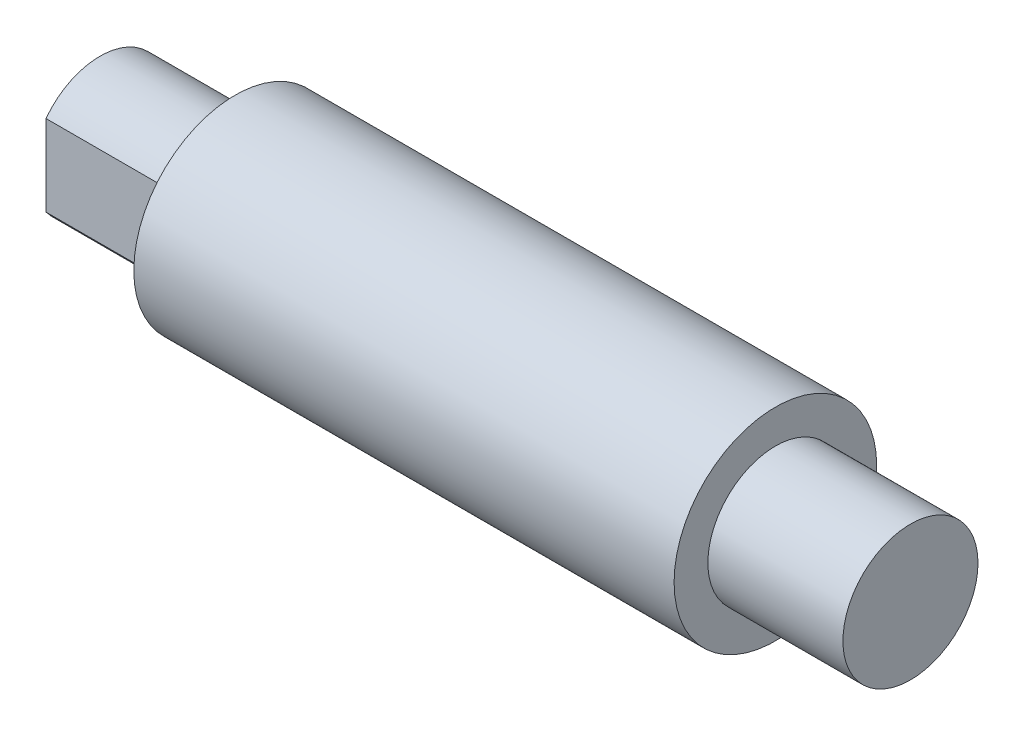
ISO-10303-21;
HEADER;
FILE_DESCRIPTION(('STEP AP214'),'2;1');
FILE_NAME('part.step','',(''),(''),'','','');
FILE_SCHEMA(('AUTOMOTIVE_DESIGN { 1 0 10303 214 1 1 1 1 }'));
ENDSEC;
DATA;
#1=APPLICATION_CONTEXT('core data for automotive mechanical design processes');
#2=APPLICATION_PROTOCOL_DEFINITION('international standard','automotive_design',2000,#1);
#3=PRODUCT_CONTEXT('',#1,'mechanical');
#4=PRODUCT('Part','Part','',(#3));
#5=PRODUCT_RELATED_PRODUCT_CATEGORY('part','',(#4));
#6=PRODUCT_DEFINITION_FORMATION('','',#4);
#7=PRODUCT_DEFINITION_CONTEXT('part definition',#1,'design');
#8=PRODUCT_DEFINITION('design','',#6,#7);
#9=PRODUCT_DEFINITION_SHAPE('','',#8);
#10=(LENGTH_UNIT() NAMED_UNIT(*) SI_UNIT(.MILLI.,.METRE.));
#11=(NAMED_UNIT(*) PLANE_ANGLE_UNIT() SI_UNIT($,.RADIAN.));
#12=(NAMED_UNIT(*) SI_UNIT($,.STERADIAN.) SOLID_ANGLE_UNIT());
#13=UNCERTAINTY_MEASURE_WITH_UNIT(LENGTH_MEASURE(1.E-05),#10,'distance_accuracy_value','');
#14=(GEOMETRIC_REPRESENTATION_CONTEXT(3) GLOBAL_UNCERTAINTY_ASSIGNED_CONTEXT((#13)) GLOBAL_UNIT_ASSIGNED_CONTEXT((#10,
#11,#12)) REPRESENTATION_CONTEXT('',''));
#15=CARTESIAN_POINT('',(0.,0.,0.));
#16=DIRECTION('',(0.,0.,1.));
#17=DIRECTION('',(1.,0.,0.));
#18=AXIS2_PLACEMENT_3D('',#15,#16,#17);
#19=CARTESIAN_POINT('',(60.,0.,0.));
#20=DIRECTION('',(-1.,0.,0.));
#21=DIRECTION('',(0.,0.,1.));
#22=AXIS2_PLACEMENT_3D('',#19,#20,#21);
#23=CYLINDRICAL_SURFACE('',#22,7.5);
#24=CARTESIAN_POINT('',(50.,0.,0.));
#25=DIRECTION('',(1.,0.,0.));
#26=DIRECTION('',(0.,0.,-1.));
#27=AXIS2_PLACEMENT_3D('',#24,#25,#26);
#28=CIRCLE('',#27,7.5);
#29=CARTESIAN_POINT('',(50.,0.,7.5));
#30=VERTEX_POINT('',#29);
#31=EDGE_CURVE('E12',#30,#30,#28,.T.);
#32=CARTESIAN_POINT('',(10.,0.,0.));
#33=DIRECTION('',(-1.,0.,0.));
#34=DIRECTION('',(0.,0.,1.));
#35=AXIS2_PLACEMENT_3D('',#32,#33,#34);
#36=CIRCLE('',#35,7.5);
#37=CARTESIAN_POINT('',(10.,0.,7.5));
#38=VERTEX_POINT('',#37);
#39=EDGE_CURVE('E38',#38,#38,#36,.T.);
#40=CARTESIAN_POINT('',(50.,0.,7.5));
#41=CARTESIAN_POINT('',(49.5833333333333,0.,7.5));
#42=CARTESIAN_POINT('',(49.1666666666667,0.,7.5));
#43=CARTESIAN_POINT('',(48.3333333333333,0.,7.5));
#44=CARTESIAN_POINT('',(47.9166666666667,0.,7.5));
#45=CARTESIAN_POINT('',(47.0833333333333,0.,7.5));
#46=CARTESIAN_POINT('',(46.6666666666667,0.,7.5));
#47=CARTESIAN_POINT('',(45.8333333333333,0.,7.5));
#48=CARTESIAN_POINT('',(45.4166666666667,0.,7.5));
#49=CARTESIAN_POINT('',(44.5833333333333,0.,7.5));
#50=CARTESIAN_POINT('',(44.1666666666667,0.,7.5));
#51=CARTESIAN_POINT('',(43.3333333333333,0.,7.5));
#52=CARTESIAN_POINT('',(42.9166666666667,0.,7.5));
#53=CARTESIAN_POINT('',(42.0833333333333,0.,7.5));
#54=CARTESIAN_POINT('',(41.6666666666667,0.,7.5));
#55=CARTESIAN_POINT('',(40.8333333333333,0.,7.5));
#56=CARTESIAN_POINT('',(40.4166666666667,0.,7.5));
#57=CARTESIAN_POINT('',(39.5833333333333,0.,7.5));
#58=CARTESIAN_POINT('',(39.1666666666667,0.,7.5));
#59=CARTESIAN_POINT('',(38.3333333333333,0.,7.5));
#60=CARTESIAN_POINT('',(37.9166666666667,0.,7.5));
#61=CARTESIAN_POINT('',(37.0833333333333,0.,7.5));
#62=CARTESIAN_POINT('',(36.6666666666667,0.,7.5));
#63=CARTESIAN_POINT('',(35.8333333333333,0.,7.5));
#64=CARTESIAN_POINT('',(35.4166666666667,0.,7.5));
#65=CARTESIAN_POINT('',(34.5833333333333,0.,7.5));
#66=CARTESIAN_POINT('',(34.1666666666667,0.,7.5));
#67=CARTESIAN_POINT('',(33.3333333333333,0.,7.5));
#68=CARTESIAN_POINT('',(32.9166666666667,0.,7.5));
#69=CARTESIAN_POINT('',(32.0833333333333,0.,7.5));
#70=CARTESIAN_POINT('',(31.6666666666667,0.,7.5));
#71=CARTESIAN_POINT('',(30.8333333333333,0.,7.5));
#72=CARTESIAN_POINT('',(30.4166666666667,0.,7.5));
#73=CARTESIAN_POINT('',(29.5833333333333,0.,7.5));
#74=CARTESIAN_POINT('',(29.1666666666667,0.,7.5));
#75=CARTESIAN_POINT('',(28.3333333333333,0.,7.5));
#76=CARTESIAN_POINT('',(27.9166666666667,0.,7.5));
#77=CARTESIAN_POINT('',(27.0833333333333,0.,7.5));
#78=CARTESIAN_POINT('',(26.6666666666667,0.,7.5));
#79=CARTESIAN_POINT('',(25.8333333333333,0.,7.5));
#80=CARTESIAN_POINT('',(25.4166666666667,0.,7.5));
#81=CARTESIAN_POINT('',(24.5833333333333,0.,7.5));
#82=CARTESIAN_POINT('',(24.1666666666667,0.,7.5));
#83=CARTESIAN_POINT('',(23.3333333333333,0.,7.5));
#84=CARTESIAN_POINT('',(22.9166666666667,0.,7.5));
#85=CARTESIAN_POINT('',(22.0833333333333,0.,7.5));
#86=CARTESIAN_POINT('',(21.6666666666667,0.,7.5));
#87=CARTESIAN_POINT('',(20.8333333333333,0.,7.5));
#88=CARTESIAN_POINT('',(20.4166666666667,0.,7.5));
#89=CARTESIAN_POINT('',(19.5833333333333,0.,7.5));
#90=CARTESIAN_POINT('',(19.1666666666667,0.,7.5));
#91=CARTESIAN_POINT('',(18.3333333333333,0.,7.5));
#92=CARTESIAN_POINT('',(17.9166666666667,0.,7.5));
#93=CARTESIAN_POINT('',(17.0833333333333,0.,7.5));
#94=CARTESIAN_POINT('',(16.6666666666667,0.,7.5));
#95=CARTESIAN_POINT('',(15.8333333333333,0.,7.5));
#96=CARTESIAN_POINT('',(15.4166666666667,0.,7.5));
#97=CARTESIAN_POINT('',(14.5833333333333,0.,7.5));
#98=CARTESIAN_POINT('',(14.1666666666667,0.,7.5));
#99=CARTESIAN_POINT('',(13.3333333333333,0.,7.5));
#100=CARTESIAN_POINT('',(12.9166666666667,0.,7.5));
#101=CARTESIAN_POINT('',(12.0833333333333,0.,7.5));
#102=CARTESIAN_POINT('',(11.6666666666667,0.,7.5));
#103=CARTESIAN_POINT('',(10.8333333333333,0.,7.5));
#104=CARTESIAN_POINT('',(10.4166666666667,0.,7.5));
#105=CARTESIAN_POINT('',(10.,0.,7.5));
#106=B_SPLINE_CURVE_WITH_KNOTS('',3,(#40,#41,#42,#43,#44,#45,#46,#47,#48,#49,#50,#51,#52,#53,
#54,#55,#56,#57,#58,#59,#60,#61,#62,#63,#64,#65,#66,#67,#68,#69,#70,#71,#72,#73,#74,#75,#76,#77,
#78,#79,#80,#81,#82,#83,#84,#85,#86,#87,#88,#89,#90,#91,#92,#93,#94,#95,#96,#97,#98,#99,#100,
#101,#102,#103,#104,#105),.UNSPECIFIED.,.F.,.F.,(4,2,2,2,2,2,2,2,2,2,2,2,2,2,2,2,2,2,2,2,2,2,2,
2,2,2,2,2,2,2,2,2,4),(0.,1.24999999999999,2.5,3.75,4.99999999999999,6.24999999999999,
7.49999999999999,8.74999999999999,9.99999999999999,11.25,12.5,13.75,15.,16.25,17.5,18.75,20.,
21.25,22.5,23.75,25.,26.25,27.5,28.75,30.,31.25,32.5,33.75,35.,36.25,37.5,38.75,40.),.UNSPECIFIED.);
#107=EDGE_CURVE('BSEAM35',#30,#38,#106,.T.);
#108=ORIENTED_EDGE('',*,*,#31,.F.);
#109=ORIENTED_EDGE('',*,*,#39,.F.);
#110=ORIENTED_EDGE('',*,*,#107,.T.);
#111=ORIENTED_EDGE('',*,*,#107,.F.);
#112=EDGE_LOOP('',(#108,#110,#109,#111));
#113=FACE_BOUND('',#112,.T.);
#114=ADVANCED_FACE('F35',(#113),#23,.T.);
#115=CARTESIAN_POINT('',(50.,0.,0.));
#116=DIRECTION('',(1.,0.,0.));
#117=DIRECTION('',(0.,0.,-1.));
#118=AXIS2_PLACEMENT_3D('',#115,#116,#117);
#119=PLANE('',#118);
#120=CARTESIAN_POINT('',(50.,0.,0.));
#121=DIRECTION('',(1.,0.,0.));
#122=DIRECTION('',(0.,0.,-1.));
#123=AXIS2_PLACEMENT_3D('',#120,#121,#122);
#124=CIRCLE('',#123,5.);
#125=CARTESIAN_POINT('',(50.,0.,-5.));
#126=VERTEX_POINT('',#125);
#127=EDGE_CURVE('E43',#126,#126,#124,.T.);
#128=ORIENTED_EDGE('',*,*,#127,.F.);
#129=EDGE_LOOP('',(#128));
#130=FACE_BOUND('',#129,.T.);
#131=ORIENTED_EDGE('',*,*,#31,.T.);
#132=EDGE_LOOP('',(#131));
#133=FACE_BOUND('',#132,.T.);
#134=ADVANCED_FACE('F123',(#130,#133),#119,.T.);
#135=CARTESIAN_POINT('',(50.,0.,0.));
#136=DIRECTION('',(1.,0.,0.));
#137=DIRECTION('',(0.,0.,-1.));
#138=AXIS2_PLACEMENT_3D('',#135,#136,#137);
#139=CYLINDRICAL_SURFACE('',#138,5.);
#140=ORIENTED_EDGE('',*,*,#127,.T.);
#141=EDGE_LOOP('',(#140));
#142=FACE_BOUND('',#141,.T.);
#143=CARTESIAN_POINT('',(60.,0.,0.));
#144=DIRECTION('',(1.,0.,0.));
#145=DIRECTION('',(0.,0.,-1.));
#146=AXIS2_PLACEMENT_3D('',#143,#144,#145);
#147=CIRCLE('',#146,5.);
#148=CARTESIAN_POINT('',(60.,0.,-5.));
#149=VERTEX_POINT('',#148);
#150=EDGE_CURVE('E115',#149,#149,#147,.T.);
#151=ORIENTED_EDGE('',*,*,#150,.F.);
#152=EDGE_LOOP('',(#151));
#153=FACE_BOUND('',#152,.T.);
#154=ADVANCED_FACE('F128',(#142,#153),#139,.T.);
#155=CARTESIAN_POINT('',(60.,0.,0.));
#156=DIRECTION('',(1.,0.,0.));
#157=DIRECTION('',(0.,0.,-1.));
#158=AXIS2_PLACEMENT_3D('',#155,#156,#157);
#159=PLANE('',#158);
#160=ORIENTED_EDGE('',*,*,#150,.T.);
#161=EDGE_LOOP('',(#160));
#162=FACE_BOUND('',#161,.T.);
#163=ADVANCED_FACE('F136',(#162),#159,.T.);
#164=CARTESIAN_POINT('',(10.,0.,0.));
#165=DIRECTION('',(-1.,0.,0.));
#166=DIRECTION('',(0.,0.,1.));
#167=AXIS2_PLACEMENT_3D('',#164,#165,#166);
#168=PLANE('',#167);
#169=DIRECTION('',(0.,1.,0.));
#170=VECTOR('',#169,1.);
#171=CARTESIAN_POINT('',(10.,-3.,4.));
#172=LINE('',#171,#170);
#173=CARTESIAN_POINT('',(10.,-3.,4.));
#174=VERTEX_POINT('',#173);
#175=CARTESIAN_POINT('',(10.,3.,4.));
#176=VERTEX_POINT('',#175);
#177=EDGE_CURVE('E88',#174,#176,#172,.T.);
#178=ORIENTED_EDGE('',*,*,#177,.F.);
#179=CARTESIAN_POINT('',(10.,0.,0.));
#180=DIRECTION('',(-1.,0.,0.));
#181=DIRECTION('',(0.,0.,1.));
#182=AXIS2_PLACEMENT_3D('',#179,#180,#181);
#183=CIRCLE('',#182,5.);
#184=CARTESIAN_POINT('',(10.,-3.,-4.));
#185=VERTEX_POINT('',#184);
#186=EDGE_CURVE('E58',#185,#174,#183,.T.);
#187=ORIENTED_EDGE('',*,*,#186,.F.);
#188=DIRECTION('',(0.,-1.,0.));
#189=VECTOR('',#188,1.);
#190=CARTESIAN_POINT('',(10.,3.,-4.));
#191=LINE('',#190,#189);
#192=CARTESIAN_POINT('',(10.,3.,-4.));
#193=VERTEX_POINT('',#192);
#194=EDGE_CURVE('E80',#193,#185,#191,.T.);
#195=ORIENTED_EDGE('',*,*,#194,.F.);
#196=CARTESIAN_POINT('',(10.,0.,0.));
#197=DIRECTION('',(-1.,0.,0.));
#198=DIRECTION('',(0.,0.,1.));
#199=AXIS2_PLACEMENT_3D('',#196,#197,#198);
#200=CIRCLE('',#199,5.);
#201=EDGE_CURVE('E93',#176,#193,#200,.T.);
#202=ORIENTED_EDGE('',*,*,#201,.F.);
#203=EDGE_LOOP('',(#178,#187,#195,#202));
#204=FACE_BOUND('',#203,.T.);
#205=ORIENTED_EDGE('',*,*,#39,.T.);
#206=EDGE_LOOP('',(#205));
#207=FACE_BOUND('',#206,.T.);
#208=ADVANCED_FACE('F91',(#204,#207),#168,.T.);
#209=CARTESIAN_POINT('',(10.,0.,0.));
#210=DIRECTION('',(-1.,0.,0.));
#211=DIRECTION('',(0.,0.,1.));
#212=AXIS2_PLACEMENT_3D('',#209,#210,#211);
#213=CYLINDRICAL_SURFACE('',#212,5.);
#214=CARTESIAN_POINT('',(0.,0.,0.));
#215=DIRECTION('',(-1.,0.,0.));
#216=DIRECTION('',(0.,0.,1.));
#217=AXIS2_PLACEMENT_3D('',#214,#215,#216);
#218=CIRCLE('',#217,5.);
#219=CARTESIAN_POINT('',(0.,3.,4.));
#220=VERTEX_POINT('',#219);
#221=CARTESIAN_POINT('',(0.,3.,-4.));
#222=VERTEX_POINT('',#221);
#223=EDGE_CURVE('E105',#220,#222,#218,.T.);
#224=ORIENTED_EDGE('',*,*,#223,.F.);
#225=DIRECTION('',(-1.,0.,0.));
#226=VECTOR('',#225,1.);
#227=CARTESIAN_POINT('',(10.,3.,4.));
#228=LINE('',#227,#226);
#229=EDGE_CURVE('E97',#176,#220,#228,.T.);
#230=ORIENTED_EDGE('',*,*,#229,.F.);
#231=ORIENTED_EDGE('',*,*,#201,.T.);
#232=DIRECTION('',(-1.,0.,0.));
#233=VECTOR('',#232,1.);
#234=CARTESIAN_POINT('',(10.,3.,-4.));
#235=LINE('',#234,#233);
#236=EDGE_CURVE('E78',#193,#222,#235,.T.);
#237=ORIENTED_EDGE('',*,*,#236,.T.);
#238=EDGE_LOOP('',(#224,#230,#231,#237));
#239=FACE_BOUND('',#238,.T.);
#240=ADVANCED_FACE('F96',(#239),#213,.T.);
#241=CARTESIAN_POINT('',(10.,-3.,4.));
#242=DIRECTION('',(0.,0.,1.));
#243=DIRECTION('',(1.,0.,0.));
#244=AXIS2_PLACEMENT_3D('',#241,#242,#243);
#245=PLANE('',#244);
#246=DIRECTION('',(0.,1.,0.));
#247=VECTOR('',#246,1.);
#248=CARTESIAN_POINT('',(0.,-3.,4.));
#249=LINE('',#248,#247);
#250=CARTESIAN_POINT('',(0.,-3.,4.));
#251=VERTEX_POINT('',#250);
#252=EDGE_CURVE('E98',#251,#220,#249,.T.);
#253=ORIENTED_EDGE('',*,*,#252,.F.);
#254=DIRECTION('',(-1.,0.,0.));
#255=VECTOR('',#254,1.);
#256=CARTESIAN_POINT('',(10.,-3.,4.));
#257=LINE('',#256,#255);
#258=EDGE_CURVE('E110',#174,#251,#257,.T.);
#259=ORIENTED_EDGE('',*,*,#258,.F.);
#260=ORIENTED_EDGE('',*,*,#177,.T.);
#261=ORIENTED_EDGE('',*,*,#229,.T.);
#262=EDGE_LOOP('',(#253,#259,#260,#261));
#263=FACE_BOUND('',#262,.T.);
#264=ADVANCED_FACE('F153',(#263),#245,.T.);
#265=CARTESIAN_POINT('',(10.,0.,0.));
#266=DIRECTION('',(-1.,0.,0.));
#267=DIRECTION('',(0.,0.,1.));
#268=AXIS2_PLACEMENT_3D('',#265,#266,#267);
#269=CYLINDRICAL_SURFACE('',#268,5.);
#270=CARTESIAN_POINT('',(0.,0.,0.));
#271=DIRECTION('',(-1.,0.,0.));
#272=DIRECTION('',(0.,0.,1.));
#273=AXIS2_PLACEMENT_3D('',#270,#271,#272);
#274=CIRCLE('',#273,5.);
#275=CARTESIAN_POINT('',(0.,-3.,-4.));
#276=VERTEX_POINT('',#275);
#277=EDGE_CURVE('E50',#276,#251,#274,.T.);
#278=ORIENTED_EDGE('',*,*,#277,.F.);
#279=DIRECTION('',(-1.,0.,0.));
#280=VECTOR('',#279,1.);
#281=CARTESIAN_POINT('',(10.,-3.,-4.));
#282=LINE('',#281,#280);
#283=EDGE_CURVE('E87',#185,#276,#282,.T.);
#284=ORIENTED_EDGE('',*,*,#283,.F.);
#285=ORIENTED_EDGE('',*,*,#186,.T.);
#286=ORIENTED_EDGE('',*,*,#258,.T.);
#287=EDGE_LOOP('',(#278,#284,#285,#286));
#288=FACE_BOUND('',#287,.T.);
#289=ADVANCED_FACE('F149',(#288),#269,.T.);
#290=CARTESIAN_POINT('',(10.,3.,-4.));
#291=DIRECTION('',(0.,0.,-1.));
#292=DIRECTION('',(-1.,0.,0.));
#293=AXIS2_PLACEMENT_3D('',#290,#291,#292);
#294=PLANE('',#293);
#295=DIRECTION('',(0.,-1.,0.));
#296=VECTOR('',#295,1.);
#297=CARTESIAN_POINT('',(0.,3.,-4.));
#298=LINE('',#297,#296);
#299=EDGE_CURVE('E82',#222,#276,#298,.T.);
#300=ORIENTED_EDGE('',*,*,#299,.F.);
#301=ORIENTED_EDGE('',*,*,#236,.F.);
#302=ORIENTED_EDGE('',*,*,#194,.T.);
#303=ORIENTED_EDGE('',*,*,#283,.T.);
#304=EDGE_LOOP('',(#300,#301,#302,#303));
#305=FACE_BOUND('',#304,.T.);
#306=ADVANCED_FACE('F79',(#305),#294,.T.);
#307=CARTESIAN_POINT('',(0.,0.,0.));
#308=DIRECTION('',(1.,0.,0.));
#309=DIRECTION('',(0.,0.,-1.));
#310=AXIS2_PLACEMENT_3D('',#307,#308,#309);
#311=PLANE('',#310);
#312=ORIENTED_EDGE('',*,*,#223,.T.);
#313=ORIENTED_EDGE('',*,*,#299,.T.);
#314=ORIENTED_EDGE('',*,*,#277,.T.);
#315=ORIENTED_EDGE('',*,*,#252,.T.);
#316=EDGE_LOOP('',(#312,#313,#314,#315));
#317=FACE_BOUND('',#316,.T.);
#318=ADVANCED_FACE('F143',(#317),#311,.F.);
#319=CLOSED_SHELL('',(#114,#134,#154,#163,#208,#240,#264,#289,#306,#318));
#320=MANIFOLD_SOLID_BREP('B2',#319);
#321=ADVANCED_BREP_SHAPE_REPRESENTATION('',(#18,#320),#14);
#322=SHAPE_DEFINITION_REPRESENTATION(#9,#321);
ENDSEC;
END-ISO-10303-21;
